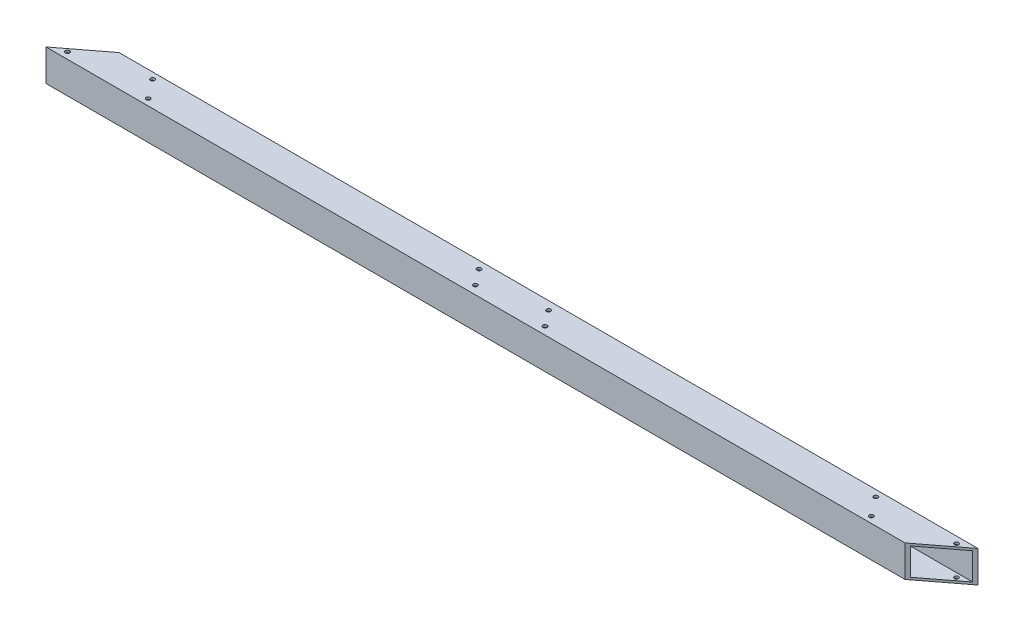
from build123d import *

# Parameters (mm, degrees)
SKETCH1_W           = 50.8
SKETCH1_H           = 50.8
SKETCH1_W_2         = 43.4848
SKETCH1_H_2         = 43.4848
EXTRUDE1_DEPTH      = 3048
SKETCH10_W          = 1961.990435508
SKETCH10_H          = 307.115176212
EXTRUDE2_DEPTH      = 3049.846549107
SKETCH11_W          = 3.896957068
SKETCH11_H          = 52.407674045
EXTRUDE3_DEPTH      = 1448.298173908
CUT_EXTRUDE8_DEPTH  = 1447.501990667
SKETCH14_R          = 3.392126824
CUT_EXTRUDE9_DEPTH  = 1447.501990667
SKETCH15_R          = 3.37312
CUT_EXTRUDE10_DEPTH = 1447.501990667


with BuildPart() as part:
    # Sketch1 → Extrude1 (new body)
    with BuildSketch(Plane(origin=(0, 0, 0), x_dir=(0, 0, -1), z_dir=(1, 0, 0))):
        with Locations((25.4, 25.4)):
            Rectangle(SKETCH1_W, SKETCH1_H)
        with Locations((25.4, 25.4)):
            Rectangle(SKETCH1_W_2, SKETCH1_H_2, mode=Mode.SUBTRACT)
    extrude(amount=EXTRUDE1_DEPTH)

    # Sketch10 → Extrude2 (cut, through all)
    with BuildSketch(Plane.XY):
        with Locations((2426.509217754, 12.917035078)):
            Rectangle(SKETCH10_W, SKETCH10_H)
    extrude(amount=-EXTRUDE2_DEPTH, mode=Mode.SUBTRACT)

    # Sketch11 → Extrude3 (cut, through all)
    with BuildSketch(Plane.XY):
        with Locations((1446.665312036, 24.596162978)):
            Rectangle(SKETCH11_W, SKETCH11_H)
    extrude(amount=-EXTRUDE3_DEPTH, mode=Mode.SUBTRACT)

    # Sketch12 → Cut-Extrude8 (cut, through all)
    with BuildSketch(Plane.XZ):
        Polygon((0, 0), (88.993764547, -68.169046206), (0, -57.652544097), align=None)
        Polygon((1444.716833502, -50.8), (1366.857806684, 8.839859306), (1444.716833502, 8.839859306), align=None)
    extrude(amount=-CUT_EXTRUDE8_DEPTH, mode=Mode.SUBTRACT)

    # Sketch14 → Cut-Extrude9 (cut, through all)
    with BuildSketch(Plane.XZ):
        with Locations(Location((788.536946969, -12.101699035, 0), (0, 0, 270))):
            Circle(SKETCH14_R)
        with Locations(Location((769.229861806, -37.306836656, 0), (0, 0, 270))):
            Circle(SKETCH14_R)
        with Locations(Location((675.486974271, -13.493163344, 0), (0, 0, 270))):
            Circle(SKETCH14_R)
        with Locations(Location((656.179889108, -38.698300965, 0), (0, 0, 270))):
            Circle(SKETCH14_R)
    extrude(amount=-CUT_EXTRUDE9_DEPTH, mode=Mode.SUBTRACT)

    # Sketch15 → Cut-Extrude10 (cut, through all)
    with BuildSketch(Plane.XZ):
        with Locations(Location((1314.209260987, -10.232805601, 0), (0, 0, 270))):
            Circle(SKETCH15_R)
        with Locations(Location((1291.040758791, -40.478970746, 0), (0, 0, 270))):
            Circle(SKETCH15_R)
        with Locations(Location((1420.734920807, -40.338421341, 0), (0, 0, 270))):
            Circle(SKETCH15_R)
        with Locations(Location((153.676074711, -10.321029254, 0), (0, 0, 270))):
            Circle(SKETCH15_R)
        with Locations(Location((130.507572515, -40.567194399, 0), (0, 0, 270))):
            Circle(SKETCH15_R)
        with Locations(Location((23.981912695, -10.461578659, 0), (0, 0, 270))):
            Circle(SKETCH15_R)
    extrude(amount=-CUT_EXTRUDE10_DEPTH, mode=Mode.SUBTRACT)


solid = part.part
